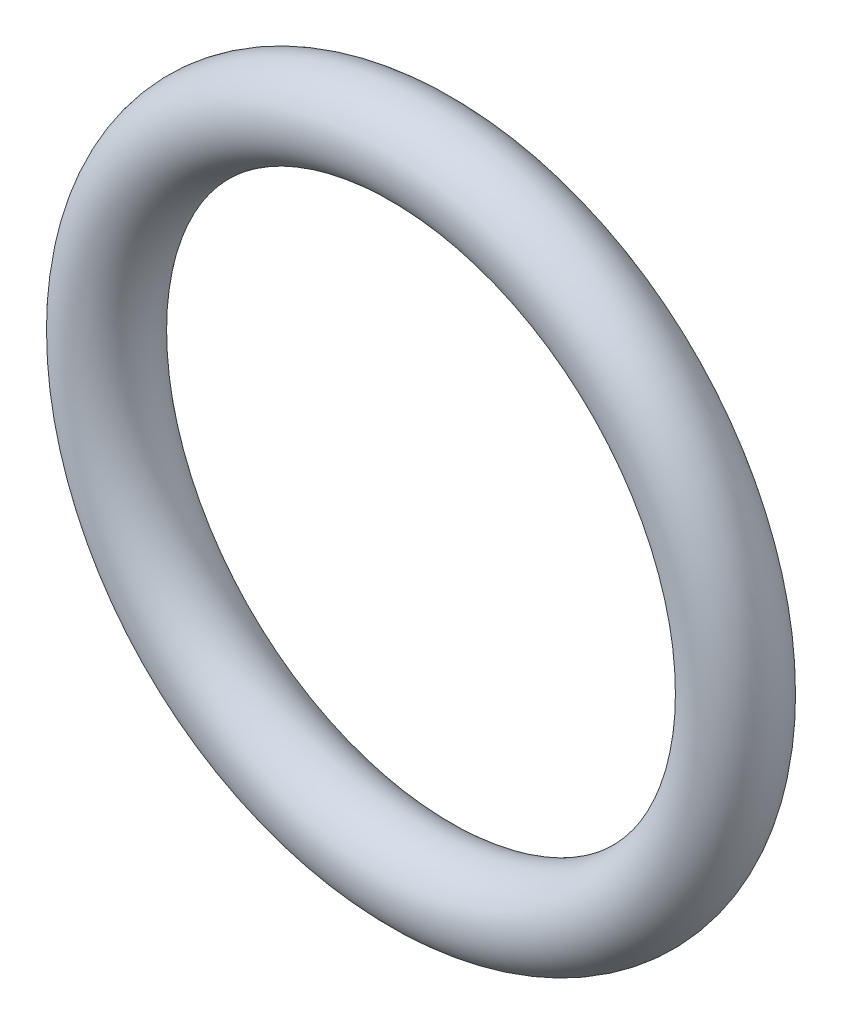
ISO-10303-21;
HEADER;
FILE_DESCRIPTION(('STEP AP214'),'2;1');
FILE_NAME('part.step','',(''),(''),'','','');
FILE_SCHEMA(('AUTOMOTIVE_DESIGN { 1 0 10303 214 1 1 1 1 }'));
ENDSEC;
DATA;
#1=APPLICATION_CONTEXT('core data for automotive mechanical design processes');
#2=APPLICATION_PROTOCOL_DEFINITION('international standard','automotive_design',2000,#1);
#3=PRODUCT_CONTEXT('',#1,'mechanical');
#4=PRODUCT('Part','Part','',(#3));
#5=PRODUCT_RELATED_PRODUCT_CATEGORY('part','',(#4));
#6=PRODUCT_DEFINITION_FORMATION('','',#4);
#7=PRODUCT_DEFINITION_CONTEXT('part definition',#1,'design');
#8=PRODUCT_DEFINITION('design','',#6,#7);
#9=PRODUCT_DEFINITION_SHAPE('','',#8);
#10=(LENGTH_UNIT() NAMED_UNIT(*) SI_UNIT(.MILLI.,.METRE.));
#11=(NAMED_UNIT(*) PLANE_ANGLE_UNIT() SI_UNIT($,.RADIAN.));
#12=(NAMED_UNIT(*) SI_UNIT($,.STERADIAN.) SOLID_ANGLE_UNIT());
#13=UNCERTAINTY_MEASURE_WITH_UNIT(LENGTH_MEASURE(1.E-05),#10,'distance_accuracy_value','');
#14=(GEOMETRIC_REPRESENTATION_CONTEXT(3) GLOBAL_UNCERTAINTY_ASSIGNED_CONTEXT((#13)) GLOBAL_UNIT_ASSIGNED_CONTEXT((#10,
#11,#12)) REPRESENTATION_CONTEXT('',''));
#15=CARTESIAN_POINT('',(0.,0.,0.));
#16=DIRECTION('',(0.,0.,1.));
#17=DIRECTION('',(1.,0.,0.));
#18=AXIS2_PLACEMENT_3D('',#15,#16,#17);
#19=CARTESIAN_POINT('',(0.,0.,1.25));
#20=DIRECTION('',(0.,0.,-1.));
#21=DIRECTION('',(-1.,0.,0.));
#22=AXIS2_PLACEMENT_3D('',#19,#20,#21);
#23=TOROIDAL_SURFACE('',#22,9.25,1.25);
#24=ADVANCED_FACE('F13',(),#23,.T.);
#25=CLOSED_SHELL('',(#24));
#26=MANIFOLD_SOLID_BREP('B1',#25);
#27=ADVANCED_BREP_SHAPE_REPRESENTATION('',(#18,#26),#14);
#28=SHAPE_DEFINITION_REPRESENTATION(#9,#27);
ENDSEC;
END-ISO-10303-21;
